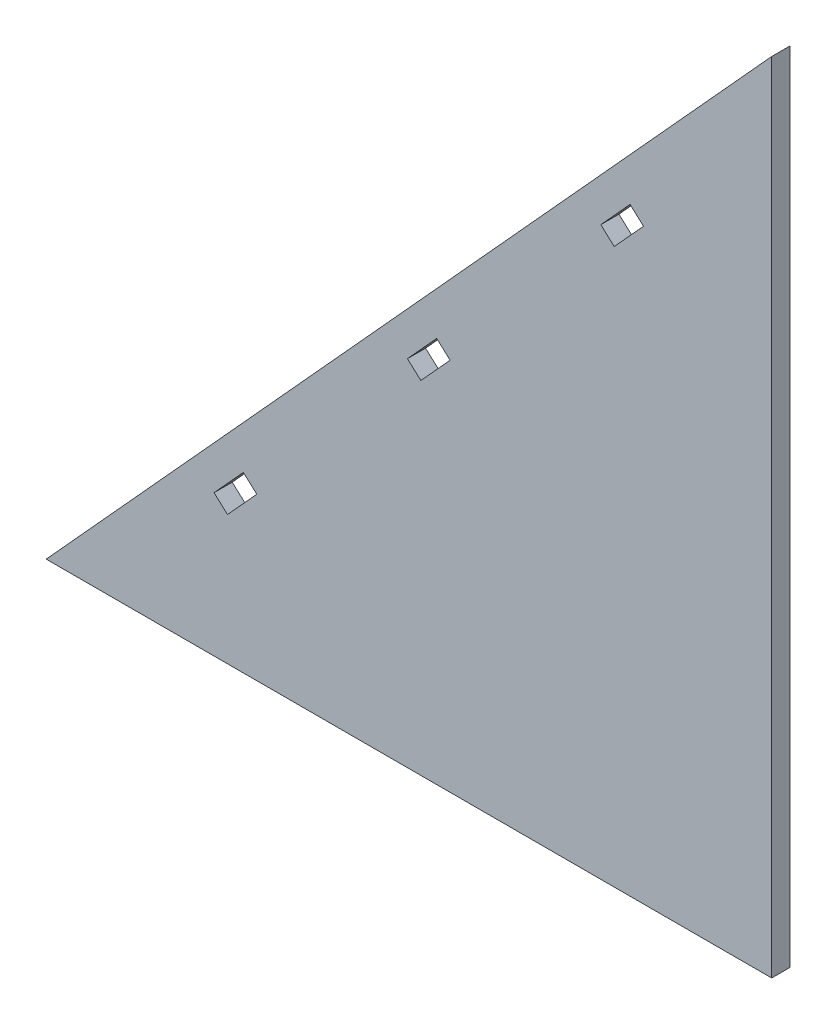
from build123d import *

# Parameters (mm, degrees)
EXTRUDE_1_DEPTH = 2.5


with BuildPart() as part:
    # Sketch 1 → Extrude 1 (new body)
    with BuildSketch(Plane.XY):
        Polygon((-0.74532394, -12.187210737), (99.25467606, -12.187210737), (99.25467606, 97.812789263), align=None)
        Polygon((75.699564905, 65.955739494), (79.735601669, 70.395379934), (81.585451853, 68.713697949), (77.549415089, 64.274057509), align=None, mode=Mode.SUBTRACT)
        Polygon((49.04898017, 36.636303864), (53.085016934, 41.075944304), (54.934867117, 39.394262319), (50.898830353, 34.954621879), align=None, mode=Mode.SUBTRACT)
        Polygon((22.398395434, 7.316868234), (26.434432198, 11.756508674), (28.284282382, 10.074826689), (24.248245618, 5.635186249), align=None, mode=Mode.SUBTRACT)
    extrude(amount=EXTRUDE_1_DEPTH)


solid = part.part
